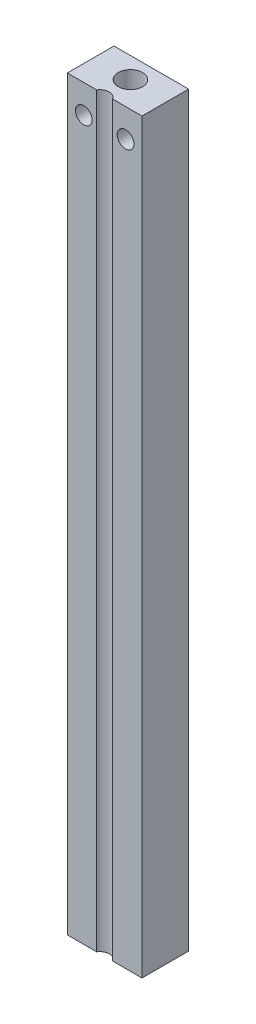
from build123d import *

# Parameters (mm, degrees)
EXTRUDE1_DEPTH     = 127
SKETCH2_R          = 2.0828
CUT_EXTRUDE1_DEPTH = 12.7
SKETCH3_R          = 1.4224
CUT_EXTRUDE2_DEPTH = 128.879998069
SKETCH4_R          = 1.6256
CUT_EXTRUDE3_DEPTH = 12.7


with BuildPart() as part:
    # Sketch1 → Extrude1 (new body)
    with BuildSketch(Plane(origin=(0, 0, 0), x_dir=(1, 0, 0), z_dir=(0, 1, 0))):
        with BuildLine():
            Line((7.705988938, 0), (12.7, 0))
            Line((12.7, 0), (12.7, 7.9375))
            Line((12.7, 7.9375), (0, 7.9375))
            Line((0, 7.9375), (0, 0))
            Line((0, 0), (4.994011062, 0))
            ThreePointArc((4.994011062, 0), (6.35, 0.762), (7.705988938, 0))
        make_face()
    extrude(amount=EXTRUDE1_DEPTH)

    # Sketch2 → Cut-Extrude1 (cut)
    with BuildSketch(Plane(origin=(0, 127, 0), x_dir=(-1, 0, 0), z_dir=(0, 1, 0))):
        with Locations(Location((-6.35, -4.3815, 0), (0, 0, 90))):
            Circle(SKETCH2_R)
    extrude(amount=-CUT_EXTRUDE1_DEPTH, mode=Mode.SUBTRACT)

    # Sketch3 → Cut-Extrude2 (cut, through all)
    with BuildSketch(Plane.XY):
        with Locations((9.906, 122.174)):
            Circle(SKETCH3_R)
        with Locations((2.794, 122.174)):
            Circle(SKETCH3_R)
    extrude(amount=-CUT_EXTRUDE2_DEPTH, mode=Mode.SUBTRACT)

    # Sketch4 → Cut-Extrude3 (cut)
    with BuildSketch(Plane.XZ):
        with Locations(Location((6.35, -2.794, 0), (0, 0, 270))):
            Circle(SKETCH4_R)
    extrude(amount=-CUT_EXTRUDE3_DEPTH, mode=Mode.SUBTRACT)


solid = part.part
